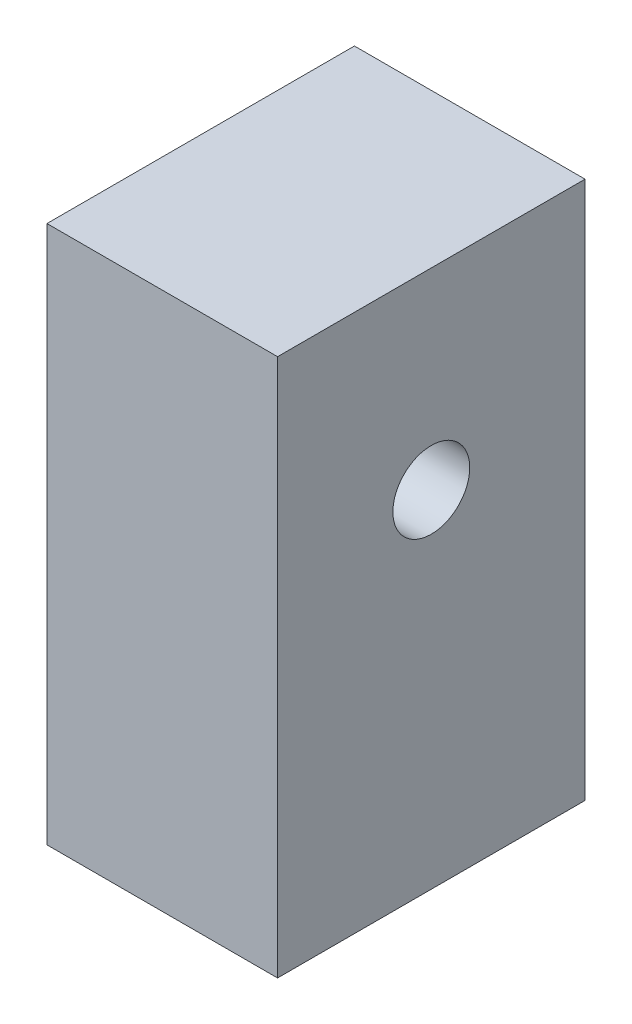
from build123d import *

# Parameters (mm, degrees)
SKETCH1_W                   = 25.4
SKETCH1_H                   = 44.45
BOSS_EXTRUDE1_DEPTH         = 9.525
F_1_4_0_25_DIAMETER_HOLE1_D = 6.35
F_10_32_TAPPED_HOLE1_D      = 4.0386
F_10_32_TAPPED_HOLE1_DEPTH  = 12.0396
F_10_32_TAPPED_HOLE1_TIP    = 1.213317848


with BuildPart() as part:
    # Sketch1 → Boss-Extrude1 (new, symmetric)
    with BuildSketch(Plane(origin=(0, 0, 0), x_dir=(0, 0, -1), z_dir=(1, 0, 0))):
        Rectangle(SKETCH1_W, SKETCH1_H)
    extrude(amount=BOSS_EXTRUDE1_DEPTH, both=True)

    # 1_4 _0.25_ Diameter Hole1 (through all)
    with Locations(Plane(origin=(9.525, 0, 0), x_dir=(0, 0, -1), z_dir=(1, 0, 0))):
        with Locations((0, 6.35)):
            Hole(F_1_4_0_25_DIAMETER_HOLE1_D / 2)

    # 10-32 Tapped Hole1
    with Locations(Plane(origin=(0, -22.225, 0), x_dir=(-1, 0, 0), z_dir=(0, -1, 0))):
        with Locations((0, -7.62), (0, 7.62)):
            Hole(F_10_32_TAPPED_HOLE1_D / 2, depth=F_10_32_TAPPED_HOLE1_DEPTH)
            with Locations((0, 0, -(F_10_32_TAPPED_HOLE1_DEPTH + F_10_32_TAPPED_HOLE1_TIP / 2))):  # 118° drill point
                Cone(0, F_10_32_TAPPED_HOLE1_D / 2, F_10_32_TAPPED_HOLE1_TIP, mode=Mode.SUBTRACT)


solid = part.part
